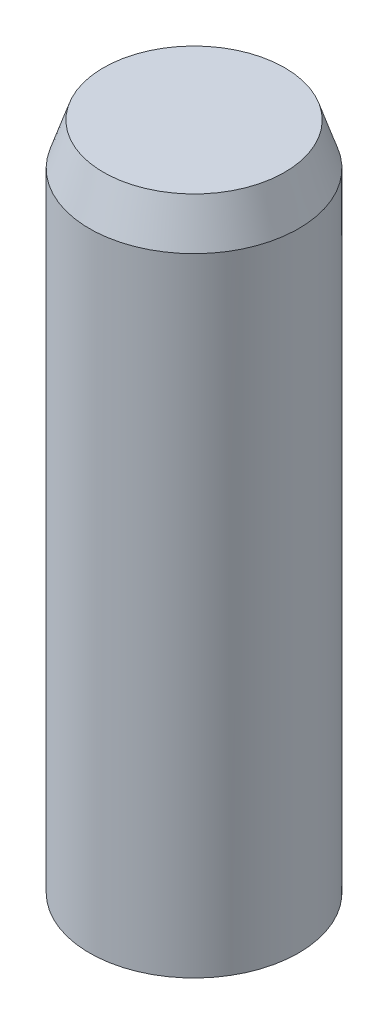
ISO-10303-21;
HEADER;
FILE_DESCRIPTION(('STEP AP214'),'2;1');
FILE_NAME('part.step','',(''),(''),'','','');
FILE_SCHEMA(('AUTOMOTIVE_DESIGN { 1 0 10303 214 1 1 1 1 }'));
ENDSEC;
DATA;
#1=APPLICATION_CONTEXT('core data for automotive mechanical design processes');
#2=APPLICATION_PROTOCOL_DEFINITION('international standard','automotive_design',2000,#1);
#3=PRODUCT_CONTEXT('',#1,'mechanical');
#4=PRODUCT('Part','Part','',(#3));
#5=PRODUCT_RELATED_PRODUCT_CATEGORY('part','',(#4));
#6=PRODUCT_DEFINITION_FORMATION('','',#4);
#7=PRODUCT_DEFINITION_CONTEXT('part definition',#1,'design');
#8=PRODUCT_DEFINITION('design','',#6,#7);
#9=PRODUCT_DEFINITION_SHAPE('','',#8);
#10=(LENGTH_UNIT() NAMED_UNIT(*) SI_UNIT(.MILLI.,.METRE.));
#11=(NAMED_UNIT(*) PLANE_ANGLE_UNIT() SI_UNIT($,.RADIAN.));
#12=(NAMED_UNIT(*) SI_UNIT($,.STERADIAN.) SOLID_ANGLE_UNIT());
#13=UNCERTAINTY_MEASURE_WITH_UNIT(LENGTH_MEASURE(1.E-05),#10,'distance_accuracy_value','');
#14=(GEOMETRIC_REPRESENTATION_CONTEXT(3) GLOBAL_UNCERTAINTY_ASSIGNED_CONTEXT((#13)) GLOBAL_UNIT_ASSIGNED_CONTEXT((#10,
#11,#12)) REPRESENTATION_CONTEXT('',''));
#15=CARTESIAN_POINT('',(0.,0.,0.));
#16=DIRECTION('',(0.,0.,1.));
#17=DIRECTION('',(1.,0.,0.));
#18=AXIS2_PLACEMENT_3D('',#15,#16,#17);
#19=CARTESIAN_POINT('',(0.,20.,0.));
#20=DIRECTION('',(0.,1.,0.));
#21=DIRECTION('',(0.,0.,1.));
#22=AXIS2_PLACEMENT_3D('',#19,#20,#21);
#23=PLANE('',#22);
#24=CARTESIAN_POINT('',(0.,20.,0.));
#25=DIRECTION('',(0.,-1.,0.));
#26=DIRECTION('',(0.,0.,-1.));
#27=AXIS2_PLACEMENT_3D('',#24,#25,#26);
#28=CIRCLE('',#27,2.6);
#29=CARTESIAN_POINT('',(0.,20.,-2.6));
#30=VERTEX_POINT('',#29);
#31=EDGE_CURVE('E10',#30,#30,#28,.T.);
#32=ORIENTED_EDGE('',*,*,#31,.F.);
#33=EDGE_LOOP('',(#32));
#34=FACE_BOUND('',#33,.T.);
#35=ADVANCED_FACE('F14',(#34),#23,.T.);
#36=CARTESIAN_POINT('',(0.,18.8,0.));
#37=DIRECTION('',(0.,-1.,0.));
#38=DIRECTION('',(0.,0.,-1.));
#39=AXIS2_PLACEMENT_3D('',#36,#37,#38);
#40=CONICAL_SURFACE('',#39,3.,0.321750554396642);
#41=ORIENTED_EDGE('',*,*,#31,.T.);
#42=EDGE_LOOP('',(#41));
#43=FACE_BOUND('',#42,.T.);
#44=CARTESIAN_POINT('',(0.,18.8,0.));
#45=DIRECTION('',(0.,-1.,0.));
#46=DIRECTION('',(0.,0.,-1.));
#47=AXIS2_PLACEMENT_3D('',#44,#45,#46);
#48=CIRCLE('',#47,3.);
#49=CARTESIAN_POINT('',(0.,18.8,-3.));
#50=VERTEX_POINT('',#49);
#51=EDGE_CURVE('E20',#50,#50,#48,.T.);
#52=ORIENTED_EDGE('',*,*,#51,.F.);
#53=EDGE_LOOP('',(#52));
#54=FACE_BOUND('',#53,.T.);
#55=ADVANCED_FACE('F35',(#43,#54),#40,.T.);
#56=CARTESIAN_POINT('',(0.,0.,0.));
#57=DIRECTION('',(0.,-1.,0.));
#58=DIRECTION('',(0.,0.,-1.));
#59=AXIS2_PLACEMENT_3D('',#56,#57,#58);
#60=CYLINDRICAL_SURFACE('',#59,3.);
#61=ORIENTED_EDGE('',*,*,#51,.T.);
#62=EDGE_LOOP('',(#61));
#63=FACE_BOUND('',#62,.T.);
#64=CARTESIAN_POINT('',(0.,0.80384757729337,0.));
#65=DIRECTION('',(0.,-1.,0.));
#66=DIRECTION('',(0.,0.,-1.));
#67=AXIS2_PLACEMENT_3D('',#64,#65,#66);
#68=CIRCLE('',#67,3.);
#69=CARTESIAN_POINT('',(0.,0.80384757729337,-3.));
#70=VERTEX_POINT('',#69);
#71=EDGE_CURVE('E24',#70,#70,#68,.T.);
#72=ORIENTED_EDGE('',*,*,#71,.F.);
#73=EDGE_LOOP('',(#72));
#74=FACE_BOUND('',#73,.T.);
#75=ADVANCED_FACE('F33',(#63,#74),#60,.T.);
#76=CARTESIAN_POINT('',(0.,6.,0.));
#77=DIRECTION('',(0.,-1.,0.));
#78=DIRECTION('',(1.,0.,0.));
#79=AXIS2_PLACEMENT_3D('',#76,#77,#78);
#80=SPHERICAL_SURFACE('',#79,6.);
#81=ORIENTED_EDGE('',*,*,#71,.T.);
#82=EDGE_LOOP('',(#81));
#83=FACE_BOUND('',#82,.T.);
#84=ADVANCED_FACE('F31',(#83),#80,.T.);
#85=CLOSED_SHELL('',(#35,#55,#75,#84));
#86=MANIFOLD_SOLID_BREP('B1',#85);
#87=ADVANCED_BREP_SHAPE_REPRESENTATION('',(#18,#86),#14);
#88=SHAPE_DEFINITION_REPRESENTATION(#9,#87);
ENDSEC;
END-ISO-10303-21;
